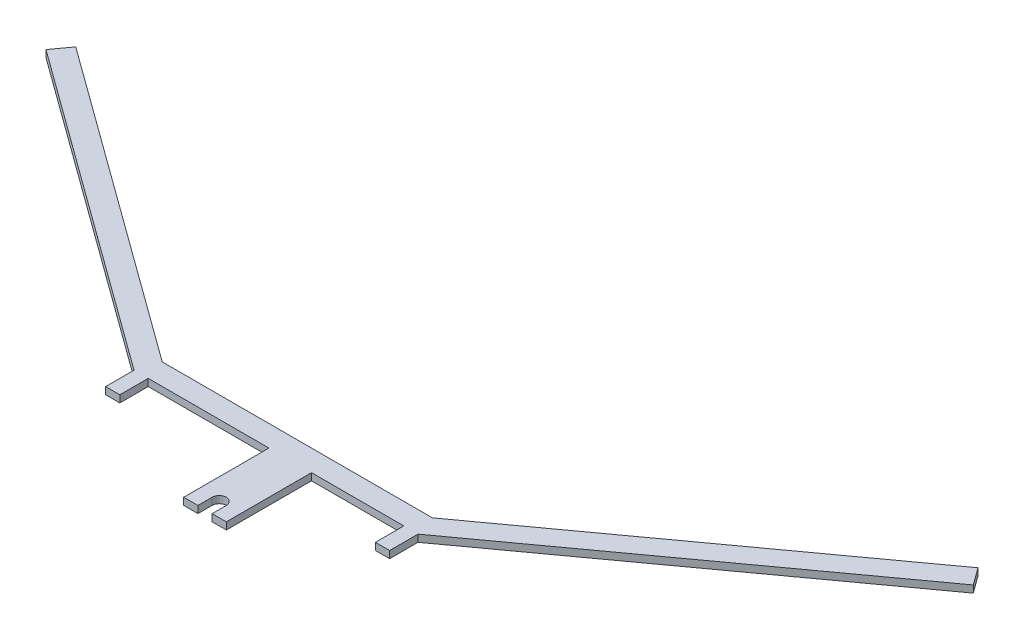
from build123d import *

# Parameters (mm, degrees)
EXTRUDE_1_DEPTH     = 0.25
SKETCH_2_W          = 1
SKETCH_2_H          = 2
EXTRUDE_2_DEPTH     = 0.5
SKETCH_5_W          = 4.537094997
SKETCH_5_H          = 4.32216947
CUT_EXTRUDE_1_DEPTH = 59.470879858
SKETCH_6_W          = 3
SKETCH_6_H          = 6
EXTRUDE_3_DEPTH     = 0.5
CUT_EXTRUDE_2_DEPTH = 62.829150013
SKETCH_8_W          = 1
SKETCH_8_H          = 2
EXTRUDE_4_DEPTH     = 0.5


with BuildPart() as part:
    # Sketch 1 → Extrude 1 (new, symmetric)
    with BuildSketch(Plane(origin=(0, 0, 0), x_dir=(1, 0, 0), z_dir=(0, 1, 0))):
        Polygon((-31.773422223, -28.831720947), (-9.512743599, -45), (9.512743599, -45), (31.773422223, -28.831720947), (32.654919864, -30.045377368), (10, -46.5), (-10, -46.5), (-32.654919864, -30.045377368), align=None)
    extrude(amount=EXTRUDE_1_DEPTH, both=True)

    # Sketch 2 → Extrude 2 (add)
    with BuildSketch(Plane(origin=(0, 0.25, 0), x_dir=(1, 0, 0), z_dir=(0, 1, 0))):
        with Locations((-9.5, -47.5)):
            Rectangle(SKETCH_2_W, SKETCH_2_H)
        with Locations((9.5, -47.5)):
            Rectangle(SKETCH_2_W, SKETCH_2_H)
    extrude(amount=-EXTRUDE_2_DEPTH)

    # Sketch 5 → Cut-Extrude 1 (cut, through all)
    with BuildSketch(Plane.XZ.offset(0.25)):
        with Locations((11.268547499, 48.661084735)):
            Rectangle(SKETCH_5_W, SKETCH_5_H)
    extrude(amount=-CUT_EXTRUDE_1_DEPTH, mode=Mode.SUBTRACT)

    # Sketch 6 → Extrude 3 (add)
    with BuildSketch(Plane.XZ.offset(0.25)):
        with Locations((1, 49.5)):
            Rectangle(SKETCH_6_W, SKETCH_6_H)
    extrude(amount=-EXTRUDE_3_DEPTH)

    # Sketch 7 → Cut-Extrude 2 (cut, through all)
    with BuildSketch(Plane.XZ.offset(0.25)):
        with BuildLine():
            Line((0.5, 51.5), (0.5, 55.278413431))
            Line((0.5, 55.278413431), (1.5, 55.278413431))
            Line((1.5, 55.278413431), (1.5, 51.5))
            ThreePointArc((1.5, 51.5), (1, 51), (0.5, 51.5))
        make_face()
    extrude(amount=-CUT_EXTRUDE_2_DEPTH, mode=Mode.SUBTRACT)

    # Sketch 8 → Extrude 4 (add)
    with BuildSketch(Plane.XZ.offset(0.25)):
        with Locations((9.5, 47.5)):
            Rectangle(SKETCH_8_W, SKETCH_8_H)
    extrude(amount=-EXTRUDE_4_DEPTH)


solid = part.part
